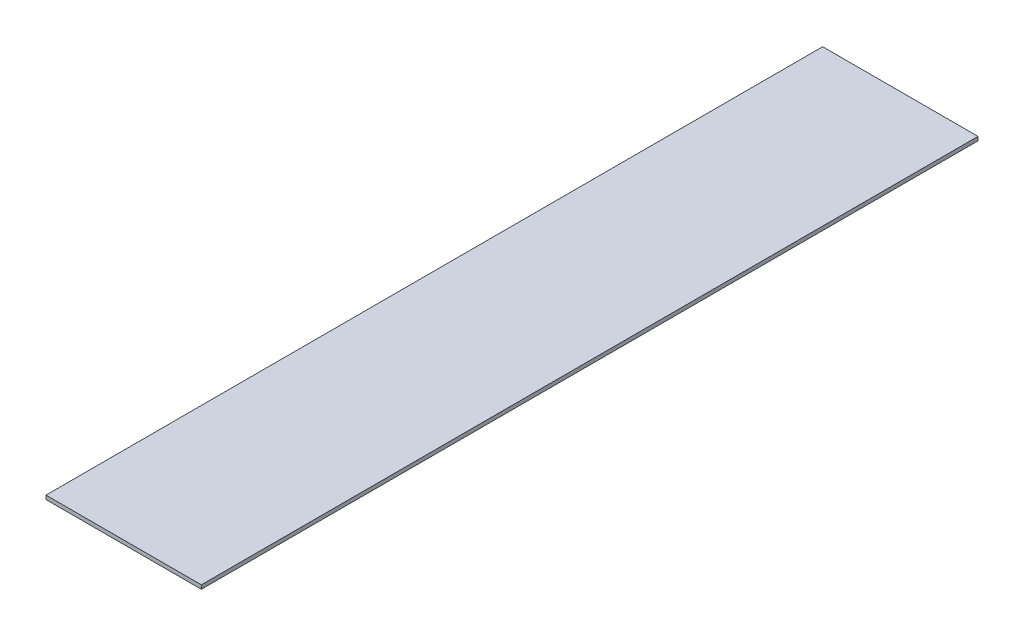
ISO-10303-21;
HEADER;
FILE_DESCRIPTION(('STEP AP214'),'2;1');
FILE_NAME('part.step','',(''),(''),'','','');
FILE_SCHEMA(('AUTOMOTIVE_DESIGN { 1 0 10303 214 1 1 1 1 }'));
ENDSEC;
DATA;
#1=APPLICATION_CONTEXT('core data for automotive mechanical design processes');
#2=APPLICATION_PROTOCOL_DEFINITION('international standard','automotive_design',2000,#1);
#3=PRODUCT_CONTEXT('',#1,'mechanical');
#4=PRODUCT('Part','Part','',(#3));
#5=PRODUCT_RELATED_PRODUCT_CATEGORY('part','',(#4));
#6=PRODUCT_DEFINITION_FORMATION('','',#4);
#7=PRODUCT_DEFINITION_CONTEXT('part definition',#1,'design');
#8=PRODUCT_DEFINITION('design','',#6,#7);
#9=PRODUCT_DEFINITION_SHAPE('','',#8);
#10=(LENGTH_UNIT() NAMED_UNIT(*) SI_UNIT(.MILLI.,.METRE.));
#11=(NAMED_UNIT(*) PLANE_ANGLE_UNIT() SI_UNIT($,.RADIAN.));
#12=(NAMED_UNIT(*) SI_UNIT($,.STERADIAN.) SOLID_ANGLE_UNIT());
#13=UNCERTAINTY_MEASURE_WITH_UNIT(LENGTH_MEASURE(1.E-05),#10,'distance_accuracy_value','');
#14=(GEOMETRIC_REPRESENTATION_CONTEXT(3) GLOBAL_UNCERTAINTY_ASSIGNED_CONTEXT((#13)) GLOBAL_UNIT_ASSIGNED_CONTEXT((#10,
#11,#12)) REPRESENTATION_CONTEXT('',''));
#15=CARTESIAN_POINT('',(0.,0.,0.));
#16=DIRECTION('',(0.,0.,1.));
#17=DIRECTION('',(1.,0.,0.));
#18=AXIS2_PLACEMENT_3D('',#15,#16,#17);
#19=CARTESIAN_POINT('',(10.,-0.25,100.));
#20=DIRECTION('',(-1.,0.,0.));
#21=DIRECTION('',(0.,0.,1.));
#22=AXIS2_PLACEMENT_3D('',#19,#20,#21);
#23=PLANE('',#22);
#24=DIRECTION('',(0.,1.,0.));
#25=VECTOR('',#24,1.);
#26=CARTESIAN_POINT('',(10.,-0.25,0.));
#27=LINE('',#26,#25);
#28=CARTESIAN_POINT('',(10.,-0.25,0.));
#29=VERTEX_POINT('',#28);
#30=CARTESIAN_POINT('',(10.,0.25,0.));
#31=VERTEX_POINT('',#30);
#32=EDGE_CURVE('E96',#29,#31,#27,.T.);
#33=ORIENTED_EDGE('',*,*,#32,.T.);
#34=DIRECTION('',(0.,0.,-1.));
#35=VECTOR('',#34,1.);
#36=CARTESIAN_POINT('',(10.,0.25,100.));
#37=LINE('',#36,#35);
#38=CARTESIAN_POINT('',(10.,0.25,100.));
#39=VERTEX_POINT('',#38);
#40=EDGE_CURVE('E11',#39,#31,#37,.T.);
#41=ORIENTED_EDGE('',*,*,#40,.F.);
#42=DIRECTION('',(0.,1.,0.));
#43=VECTOR('',#42,1.);
#44=CARTESIAN_POINT('',(10.,-0.25,100.));
#45=LINE('',#44,#43);
#46=CARTESIAN_POINT('',(10.,-0.25,100.));
#47=VERTEX_POINT('',#46);
#48=EDGE_CURVE('E84',#47,#39,#45,.T.);
#49=ORIENTED_EDGE('',*,*,#48,.F.);
#50=DIRECTION('',(0.,0.,-1.));
#51=VECTOR('',#50,1.);
#52=CARTESIAN_POINT('',(10.,-0.25,100.));
#53=LINE('',#52,#51);
#54=EDGE_CURVE('E92',#47,#29,#53,.T.);
#55=ORIENTED_EDGE('',*,*,#54,.T.);
#56=EDGE_LOOP('',(#33,#41,#49,#55));
#57=FACE_BOUND('',#56,.T.);
#58=ADVANCED_FACE('F33',(#57),#23,.F.);
#59=CARTESIAN_POINT('',(-9.99999999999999,0.25,100.));
#60=DIRECTION('',(0.,-1.,0.));
#61=DIRECTION('',(0.,0.,-1.));
#62=AXIS2_PLACEMENT_3D('',#59,#60,#61);
#63=PLANE('',#62);
#64=DIRECTION('',(-1.,0.,0.));
#65=VECTOR('',#64,1.);
#66=CARTESIAN_POINT('',(-9.99999999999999,0.25,0.));
#67=LINE('',#66,#65);
#68=CARTESIAN_POINT('',(-9.99999999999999,0.25,0.));
#69=VERTEX_POINT('',#68);
#70=EDGE_CURVE('E88',#31,#69,#67,.T.);
#71=ORIENTED_EDGE('',*,*,#70,.T.);
#72=DIRECTION('',(0.,0.,-1.));
#73=VECTOR('',#72,1.);
#74=CARTESIAN_POINT('',(-9.99999999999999,0.25,100.));
#75=LINE('',#74,#73);
#76=CARTESIAN_POINT('',(-9.99999999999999,0.25,100.));
#77=VERTEX_POINT('',#76);
#78=EDGE_CURVE('E41',#77,#69,#75,.T.);
#79=ORIENTED_EDGE('',*,*,#78,.F.);
#80=DIRECTION('',(-1.,0.,0.));
#81=VECTOR('',#80,1.);
#82=CARTESIAN_POINT('',(-9.99999999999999,0.25,100.));
#83=LINE('',#82,#81);
#84=EDGE_CURVE('E79',#39,#77,#83,.T.);
#85=ORIENTED_EDGE('',*,*,#84,.F.);
#86=ORIENTED_EDGE('',*,*,#40,.T.);
#87=EDGE_LOOP('',(#71,#79,#85,#86));
#88=FACE_BOUND('',#87,.T.);
#89=ADVANCED_FACE('F87',(#88),#63,.F.);
#90=CARTESIAN_POINT('',(-9.99999999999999,-0.25,100.));
#91=DIRECTION('',(1.,0.,0.));
#92=DIRECTION('',(0.,0.,-1.));
#93=AXIS2_PLACEMENT_3D('',#90,#91,#92);
#94=PLANE('',#93);
#95=DIRECTION('',(0.,-1.,0.));
#96=VECTOR('',#95,1.);
#97=CARTESIAN_POINT('',(-9.99999999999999,-0.25,0.));
#98=LINE('',#97,#96);
#99=CARTESIAN_POINT('',(-9.99999999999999,-0.25,0.));
#100=VERTEX_POINT('',#99);
#101=EDGE_CURVE('E66',#69,#100,#98,.T.);
#102=ORIENTED_EDGE('',*,*,#101,.T.);
#103=DIRECTION('',(0.,0.,-1.));
#104=VECTOR('',#103,1.);
#105=CARTESIAN_POINT('',(-9.99999999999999,-0.25,100.));
#106=LINE('',#105,#104);
#107=CARTESIAN_POINT('',(-9.99999999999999,-0.25,100.));
#108=VERTEX_POINT('',#107);
#109=EDGE_CURVE('E89',#108,#100,#106,.T.);
#110=ORIENTED_EDGE('',*,*,#109,.F.);
#111=DIRECTION('',(0.,-1.,0.));
#112=VECTOR('',#111,1.);
#113=CARTESIAN_POINT('',(-9.99999999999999,-0.25,100.));
#114=LINE('',#113,#112);
#115=EDGE_CURVE('E82',#77,#108,#114,.T.);
#116=ORIENTED_EDGE('',*,*,#115,.F.);
#117=ORIENTED_EDGE('',*,*,#78,.T.);
#118=EDGE_LOOP('',(#102,#110,#116,#117));
#119=FACE_BOUND('',#118,.T.);
#120=ADVANCED_FACE('F90',(#119),#94,.F.);
#121=CARTESIAN_POINT('',(-9.99999999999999,-0.25,100.));
#122=DIRECTION('',(0.,1.,0.));
#123=DIRECTION('',(0.,0.,1.));
#124=AXIS2_PLACEMENT_3D('',#121,#122,#123);
#125=PLANE('',#124);
#126=DIRECTION('',(1.,0.,0.));
#127=VECTOR('',#126,1.);
#128=CARTESIAN_POINT('',(-9.99999999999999,-0.25,0.));
#129=LINE('',#128,#127);
#130=EDGE_CURVE('E72',#100,#29,#129,.T.);
#131=ORIENTED_EDGE('',*,*,#130,.T.);
#132=ORIENTED_EDGE('',*,*,#54,.F.);
#133=DIRECTION('',(1.,0.,0.));
#134=VECTOR('',#133,1.);
#135=CARTESIAN_POINT('',(-9.99999999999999,-0.25,100.));
#136=LINE('',#135,#134);
#137=EDGE_CURVE('E49',#108,#47,#136,.T.);
#138=ORIENTED_EDGE('',*,*,#137,.F.);
#139=ORIENTED_EDGE('',*,*,#109,.T.);
#140=EDGE_LOOP('',(#131,#132,#138,#139));
#141=FACE_BOUND('',#140,.T.);
#142=ADVANCED_FACE('F103',(#141),#125,.F.);
#143=CARTESIAN_POINT('',(10.,0.25,100.));
#144=DIRECTION('',(0.,0.,-1.));
#145=DIRECTION('',(-1.,0.,0.));
#146=AXIS2_PLACEMENT_3D('',#143,#144,#145);
#147=PLANE('',#146);
#148=ORIENTED_EDGE('',*,*,#48,.T.);
#149=ORIENTED_EDGE('',*,*,#84,.T.);
#150=ORIENTED_EDGE('',*,*,#115,.T.);
#151=ORIENTED_EDGE('',*,*,#137,.T.);
#152=EDGE_LOOP('',(#148,#149,#150,#151));
#153=FACE_BOUND('',#152,.T.);
#154=ADVANCED_FACE('F80',(#153),#147,.F.);
#155=CARTESIAN_POINT('',(10.,0.25,0.));
#156=DIRECTION('',(0.,0.,-1.));
#157=DIRECTION('',(-1.,0.,0.));
#158=AXIS2_PLACEMENT_3D('',#155,#156,#157);
#159=PLANE('',#158);
#160=ORIENTED_EDGE('',*,*,#32,.F.);
#161=ORIENTED_EDGE('',*,*,#130,.F.);
#162=ORIENTED_EDGE('',*,*,#101,.F.);
#163=ORIENTED_EDGE('',*,*,#70,.F.);
#164=EDGE_LOOP('',(#160,#161,#162,#163));
#165=FACE_BOUND('',#164,.T.);
#166=ADVANCED_FACE('F106',(#165),#159,.T.);
#167=CLOSED_SHELL('',(#58,#89,#120,#142,#154,#166));
#168=MANIFOLD_SOLID_BREP('B2',#167);
#169=ADVANCED_BREP_SHAPE_REPRESENTATION('',(#18,#168),#14);
#170=SHAPE_DEFINITION_REPRESENTATION(#9,#169);
ENDSEC;
END-ISO-10303-21;
